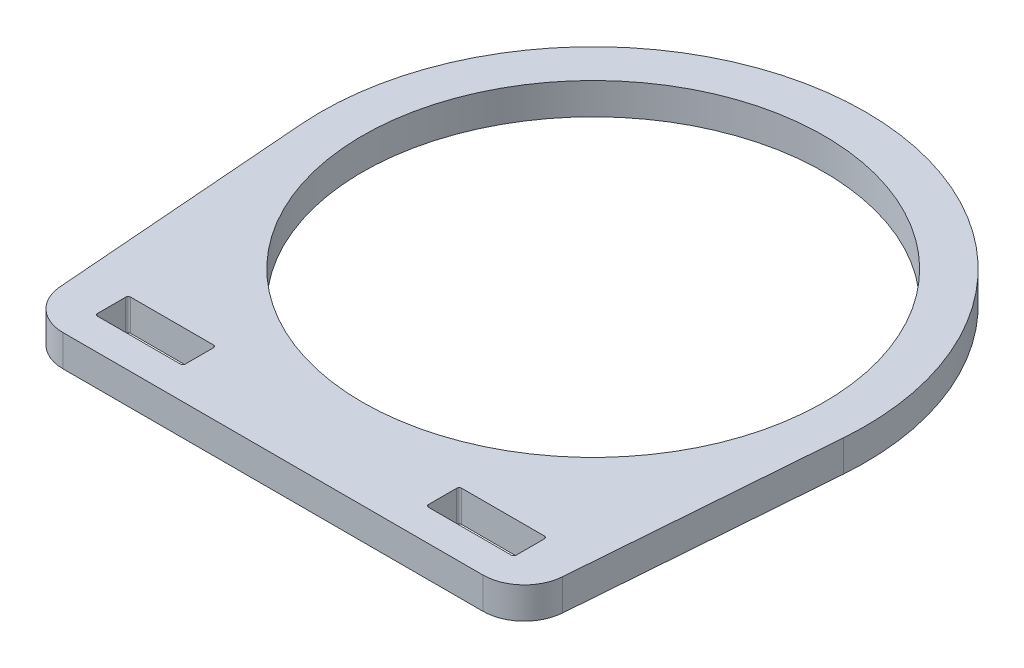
ISO-10303-21;
HEADER;
FILE_DESCRIPTION(('STEP AP214'),'2;1');
FILE_NAME('part.step','',(''),(''),'','','');
FILE_SCHEMA(('AUTOMOTIVE_DESIGN { 1 0 10303 214 1 1 1 1 }'));
ENDSEC;
DATA;
#1=APPLICATION_CONTEXT('core data for automotive mechanical design processes');
#2=APPLICATION_PROTOCOL_DEFINITION('international standard','automotive_design',2000,#1);
#3=PRODUCT_CONTEXT('',#1,'mechanical');
#4=PRODUCT('Part','Part','',(#3));
#5=PRODUCT_RELATED_PRODUCT_CATEGORY('part','',(#4));
#6=PRODUCT_DEFINITION_FORMATION('','',#4);
#7=PRODUCT_DEFINITION_CONTEXT('part definition',#1,'design');
#8=PRODUCT_DEFINITION('design','',#6,#7);
#9=PRODUCT_DEFINITION_SHAPE('','',#8);
#10=(LENGTH_UNIT() NAMED_UNIT(*) SI_UNIT(.MILLI.,.METRE.));
#11=(NAMED_UNIT(*) PLANE_ANGLE_UNIT() SI_UNIT($,.RADIAN.));
#12=(NAMED_UNIT(*) SI_UNIT($,.STERADIAN.) SOLID_ANGLE_UNIT());
#13=UNCERTAINTY_MEASURE_WITH_UNIT(LENGTH_MEASURE(1.E-05),#10,'distance_accuracy_value','');
#14=(GEOMETRIC_REPRESENTATION_CONTEXT(3) GLOBAL_UNCERTAINTY_ASSIGNED_CONTEXT((#13)) GLOBAL_UNIT_ASSIGNED_CONTEXT((#10,
#11,#12)) REPRESENTATION_CONTEXT('',''));
#15=CARTESIAN_POINT('',(0.,0.,0.));
#16=DIRECTION('',(0.,0.,1.));
#17=DIRECTION('',(1.,0.,0.));
#18=AXIS2_PLACEMENT_3D('',#15,#16,#17);
#19=CARTESIAN_POINT('',(0.,9.652,-98.298));
#20=DIRECTION('',(0.,-1.,0.));
#21=DIRECTION('',(0.,0.,-1.));
#22=AXIS2_PLACEMENT_3D('',#19,#20,#21);
#23=PLANE('',#22);
#24=DIRECTION('',(0.,0.,1.));
#25=VECTOR('',#24,1.);
#26=CARTESIAN_POINT('',(-64.262,9.652,-19.812));
#27=LINE('',#26,#25);
#28=CARTESIAN_POINT('',(-64.262,9.652,-19.05));
#29=VERTEX_POINT('',#28);
#30=CARTESIAN_POINT('',(-64.262,9.652,-10.414));
#31=VERTEX_POINT('',#30);
#32=EDGE_CURVE('E314',#29,#31,#27,.T.);
#33=ORIENTED_EDGE('',*,*,#32,.F.);
#34=CARTESIAN_POINT('',(-63.5,9.652,-19.05));
#35=DIRECTION('',(0.,-1.,0.));
#36=DIRECTION('',(0.,0.,-1.));
#37=AXIS2_PLACEMENT_3D('',#34,#35,#36);
#38=CIRCLE('',#37,0.762);
#39=CARTESIAN_POINT('',(-63.5,9.652,-19.812));
#40=VERTEX_POINT('',#39);
#41=EDGE_CURVE('E295',#29,#40,#38,.T.);
#42=ORIENTED_EDGE('',*,*,#41,.T.);
#43=DIRECTION('',(-1.,0.,0.));
#44=VECTOR('',#43,1.);
#45=CARTESIAN_POINT('',(-64.262,9.652,-19.812));
#46=LINE('',#45,#44);
#47=CARTESIAN_POINT('',(-38.1,9.652,-19.812));
#48=VERTEX_POINT('',#47);
#49=EDGE_CURVE('E327',#48,#40,#46,.T.);
#50=ORIENTED_EDGE('',*,*,#49,.F.);
#51=CARTESIAN_POINT('',(-38.1,9.652,-19.05));
#52=DIRECTION('',(0.,-1.,0.));
#53=DIRECTION('',(0.,0.,-1.));
#54=AXIS2_PLACEMENT_3D('',#51,#52,#53);
#55=CIRCLE('',#54,0.762);
#56=CARTESIAN_POINT('',(-37.338,9.652,-19.05));
#57=VERTEX_POINT('',#56);
#58=EDGE_CURVE('E291',#48,#57,#55,.T.);
#59=ORIENTED_EDGE('',*,*,#58,.T.);
#60=DIRECTION('',(0.,0.,-1.));
#61=VECTOR('',#60,1.);
#62=CARTESIAN_POINT('',(-37.338,9.652,-19.812));
#63=LINE('',#62,#61);
#64=CARTESIAN_POINT('',(-37.338,9.652,-10.414));
#65=VERTEX_POINT('',#64);
#66=EDGE_CURVE('E319',#65,#57,#63,.T.);
#67=ORIENTED_EDGE('',*,*,#66,.F.);
#68=CARTESIAN_POINT('',(-38.1,9.652,-10.414));
#69=DIRECTION('',(0.,-1.,0.));
#70=DIRECTION('',(0.,0.,-1.));
#71=AXIS2_PLACEMENT_3D('',#68,#69,#70);
#72=CIRCLE('',#71,0.762);
#73=CARTESIAN_POINT('',(-38.1,9.652,-9.652));
#74=VERTEX_POINT('',#73);
#75=EDGE_CURVE('E287',#65,#74,#72,.T.);
#76=ORIENTED_EDGE('',*,*,#75,.T.);
#77=DIRECTION('',(1.,0.,0.));
#78=VECTOR('',#77,1.);
#79=CARTESIAN_POINT('',(-64.262,9.652,-9.652));
#80=LINE('',#79,#78);
#81=CARTESIAN_POINT('',(-63.5,9.652,-9.652));
#82=VERTEX_POINT('',#81);
#83=EDGE_CURVE('E316',#82,#74,#80,.T.);
#84=ORIENTED_EDGE('',*,*,#83,.F.);
#85=CARTESIAN_POINT('',(-63.5,9.652,-10.414));
#86=DIRECTION('',(0.,-1.,0.));
#87=DIRECTION('',(0.,0.,-1.));
#88=AXIS2_PLACEMENT_3D('',#85,#86,#87);
#89=CIRCLE('',#88,0.762);
#90=EDGE_CURVE('E11',#82,#31,#89,.T.);
#91=ORIENTED_EDGE('',*,*,#90,.T.);
#92=EDGE_LOOP('',(#33,#42,#50,#59,#67,#76,#84,#91));
#93=FACE_BOUND('',#92,.T.);
#94=DIRECTION('',(1.,0.,0.));
#95=VECTOR('',#94,1.);
#96=CARTESIAN_POINT('',(-76.2,9.652,0.));
#97=LINE('',#96,#95);
#98=CARTESIAN_POINT('',(-64.4459745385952,9.652,0.));
#99=VERTEX_POINT('',#98);
#100=CARTESIAN_POINT('',(64.4459745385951,9.652,0.));
#101=VERTEX_POINT('',#100);
#102=EDGE_CURVE('E204',#99,#101,#97,.T.);
#103=ORIENTED_EDGE('',*,*,#102,.T.);
#104=CARTESIAN_POINT('',(64.4459745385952,9.652,-12.7));
#105=DIRECTION('',(0.,-1.,0.));
#106=DIRECTION('',(0.,0.,-1.));
#107=AXIS2_PLACEMENT_3D('',#104,#105,#106);
#108=CIRCLE('',#107,12.7);
#109=CARTESIAN_POINT('',(77.1080218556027,9.652,-11.7188997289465));
#110=VERTEX_POINT('',#109);
#111=EDGE_CURVE('E226',#101,#110,#108,.F.);
#112=ORIENTED_EDGE('',*,*,#111,.T.);
#113=DIRECTION('',(0.0772519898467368,0.,-0.997011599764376));
#114=VECTOR('',#113,1.);
#115=CARTESIAN_POINT('',(76.2,9.652,0.));
#116=LINE('',#115,#114);
#117=CARTESIAN_POINT('',(83.3162713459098,9.652,-91.8423602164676));
#118=VERTEX_POINT('',#117);
#119=EDGE_CURVE('E210',#110,#118,#116,.T.);
#120=ORIENTED_EDGE('',*,*,#119,.T.);
#121=CARTESIAN_POINT('',(0.,9.652,-98.298));
#122=DIRECTION('',(0.,1.,0.));
#123=DIRECTION('',(0.,0.,-1.));
#124=AXIS2_PLACEMENT_3D('',#121,#122,#123);
#125=CIRCLE('',#124,83.566);
#126=CARTESIAN_POINT('',(-83.3162713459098,9.652,-91.8423602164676));
#127=VERTEX_POINT('',#126);
#128=EDGE_CURVE('E193',#118,#127,#125,.T.);
#129=ORIENTED_EDGE('',*,*,#128,.T.);
#130=DIRECTION('',(0.0772519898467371,0.,0.997011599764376));
#131=VECTOR('',#130,1.);
#132=CARTESIAN_POINT('',(-76.2,9.652,0.));
#133=LINE('',#132,#131);
#134=CARTESIAN_POINT('',(-77.1080218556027,9.652,-11.7188997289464));
#135=VERTEX_POINT('',#134);
#136=EDGE_CURVE('E201',#127,#135,#133,.T.);
#137=ORIENTED_EDGE('',*,*,#136,.T.);
#138=CARTESIAN_POINT('',(-64.4459745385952,9.652,-12.7));
#139=DIRECTION('',(0.,-1.,0.));
#140=DIRECTION('',(0.,0.,-1.));
#141=AXIS2_PLACEMENT_3D('',#138,#139,#140);
#142=CIRCLE('',#141,12.7);
#143=EDGE_CURVE('E224',#135,#99,#142,.F.);
#144=ORIENTED_EDGE('',*,*,#143,.T.);
#145=EDGE_LOOP('',(#103,#112,#120,#129,#137,#144));
#146=FACE_BOUND('',#145,.T.);
#147=CARTESIAN_POINT('',(0.,9.652,-98.298));
#148=DIRECTION('',(0.,1.,0.));
#149=DIRECTION('',(0.,0.,1.));
#150=AXIS2_PLACEMENT_3D('',#147,#148,#149);
#151=CIRCLE('',#150,70.866);
#152=CARTESIAN_POINT('',(0.,9.652,-27.432));
#153=VERTEX_POINT('',#152);
#154=EDGE_CURVE('E333',#153,#153,#151,.T.);
#155=ORIENTED_EDGE('',*,*,#154,.F.);
#156=EDGE_LOOP('',(#155));
#157=FACE_BOUND('',#156,.T.);
#158=DIRECTION('',(0.,0.,1.));
#159=VECTOR('',#158,1.);
#160=CARTESIAN_POINT('',(37.338,9.652,-19.812));
#161=LINE('',#160,#159);
#162=CARTESIAN_POINT('',(37.338,9.652,-19.05));
#163=VERTEX_POINT('',#162);
#164=CARTESIAN_POINT('',(37.338,9.652,-10.414));
#165=VERTEX_POINT('',#164);
#166=EDGE_CURVE('E498',#163,#165,#161,.T.);
#167=ORIENTED_EDGE('',*,*,#166,.F.);
#168=CARTESIAN_POINT('',(38.1,9.652,-19.05));
#169=DIRECTION('',(0.,-1.,0.));
#170=DIRECTION('',(0.,0.,-1.));
#171=AXIS2_PLACEMENT_3D('',#168,#169,#170);
#172=CIRCLE('',#171,0.762);
#173=CARTESIAN_POINT('',(38.1,9.652,-19.812));
#174=VERTEX_POINT('',#173);
#175=EDGE_CURVE('E275',#163,#174,#172,.T.);
#176=ORIENTED_EDGE('',*,*,#175,.T.);
#177=DIRECTION('',(-1.,0.,0.));
#178=VECTOR('',#177,1.);
#179=CARTESIAN_POINT('',(37.338,9.652,-19.812));
#180=LINE('',#179,#178);
#181=CARTESIAN_POINT('',(63.5,9.652,-19.812));
#182=VERTEX_POINT('',#181);
#183=EDGE_CURVE('E512',#182,#174,#180,.T.);
#184=ORIENTED_EDGE('',*,*,#183,.F.);
#185=CARTESIAN_POINT('',(63.5,9.652,-19.05));
#186=DIRECTION('',(0.,-1.,0.));
#187=DIRECTION('',(0.,0.,-1.));
#188=AXIS2_PLACEMENT_3D('',#185,#186,#187);
#189=CIRCLE('',#188,0.762);
#190=CARTESIAN_POINT('',(64.262,9.652,-19.05));
#191=VERTEX_POINT('',#190);
#192=EDGE_CURVE('E271',#182,#191,#189,.T.);
#193=ORIENTED_EDGE('',*,*,#192,.T.);
#194=DIRECTION('',(0.,0.,-1.));
#195=VECTOR('',#194,1.);
#196=CARTESIAN_POINT('',(64.262,9.652,-19.812));
#197=LINE('',#196,#195);
#198=CARTESIAN_POINT('',(64.262,9.652,-10.414));
#199=VERTEX_POINT('',#198);
#200=EDGE_CURVE('E509',#199,#191,#197,.T.);
#201=ORIENTED_EDGE('',*,*,#200,.F.);
#202=CARTESIAN_POINT('',(63.5,9.652,-10.414));
#203=DIRECTION('',(0.,-1.,0.));
#204=DIRECTION('',(0.,0.,-1.));
#205=AXIS2_PLACEMENT_3D('',#202,#203,#204);
#206=CIRCLE('',#205,0.762);
#207=CARTESIAN_POINT('',(63.5,9.652,-9.652));
#208=VERTEX_POINT('',#207);
#209=EDGE_CURVE('E283',#199,#208,#206,.T.);
#210=ORIENTED_EDGE('',*,*,#209,.T.);
#211=DIRECTION('',(1.,0.,0.));
#212=VECTOR('',#211,1.);
#213=CARTESIAN_POINT('',(37.338,9.652,-9.652));
#214=LINE('',#213,#212);
#215=CARTESIAN_POINT('',(38.1,9.652,-9.652));
#216=VERTEX_POINT('',#215);
#217=EDGE_CURVE('E506',#216,#208,#214,.T.);
#218=ORIENTED_EDGE('',*,*,#217,.F.);
#219=CARTESIAN_POINT('',(38.1,9.652,-10.414));
#220=DIRECTION('',(0.,-1.,0.));
#221=DIRECTION('',(0.,0.,-1.));
#222=AXIS2_PLACEMENT_3D('',#219,#220,#221);
#223=CIRCLE('',#222,0.762);
#224=EDGE_CURVE('E279',#216,#165,#223,.T.);
#225=ORIENTED_EDGE('',*,*,#224,.T.);
#226=EDGE_LOOP('',(#167,#176,#184,#193,#201,#210,#218,#225));
#227=FACE_BOUND('',#226,.T.);
#228=ADVANCED_FACE('F26',(#93,#146,#157,#227),#23,.F.);
#229=CARTESIAN_POINT('',(0.,0.,-98.298));
#230=DIRECTION('',(0.,-1.,0.));
#231=DIRECTION('',(0.,0.,-1.));
#232=AXIS2_PLACEMENT_3D('',#229,#230,#231);
#233=PLANE('',#232);
#234=DIRECTION('',(0.,0.,-1.));
#235=VECTOR('',#234,1.);
#236=CARTESIAN_POINT('',(-37.338,0.,-19.812));
#237=LINE('',#236,#235);
#238=CARTESIAN_POINT('',(-37.338,0.,-10.414));
#239=VERTEX_POINT('',#238);
#240=CARTESIAN_POINT('',(-37.338,0.,-19.05));
#241=VERTEX_POINT('',#240);
#242=EDGE_CURVE('E310',#239,#241,#237,.T.);
#243=ORIENTED_EDGE('',*,*,#242,.T.);
#244=CARTESIAN_POINT('',(-38.1,0.,-19.05));
#245=DIRECTION('',(0.,-1.,0.));
#246=DIRECTION('',(0.,0.,-1.));
#247=AXIS2_PLACEMENT_3D('',#244,#245,#246);
#248=CIRCLE('',#247,0.762);
#249=CARTESIAN_POINT('',(-38.1,0.,-19.812));
#250=VERTEX_POINT('',#249);
#251=EDGE_CURVE('E289',#241,#250,#248,.F.);
#252=ORIENTED_EDGE('',*,*,#251,.T.);
#253=DIRECTION('',(-1.,0.,0.));
#254=VECTOR('',#253,1.);
#255=CARTESIAN_POINT('',(-64.262,0.,-19.812));
#256=LINE('',#255,#254);
#257=CARTESIAN_POINT('',(-63.5,0.,-19.812));
#258=VERTEX_POINT('',#257);
#259=EDGE_CURVE('E317',#250,#258,#256,.T.);
#260=ORIENTED_EDGE('',*,*,#259,.T.);
#261=CARTESIAN_POINT('',(-63.5,0.,-19.05));
#262=DIRECTION('',(0.,-1.,0.));
#263=DIRECTION('',(0.,0.,-1.));
#264=AXIS2_PLACEMENT_3D('',#261,#262,#263);
#265=CIRCLE('',#264,0.762);
#266=CARTESIAN_POINT('',(-64.262,0.,-19.05));
#267=VERTEX_POINT('',#266);
#268=EDGE_CURVE('E293',#258,#267,#265,.F.);
#269=ORIENTED_EDGE('',*,*,#268,.T.);
#270=DIRECTION('',(0.,0.,1.));
#271=VECTOR('',#270,1.);
#272=CARTESIAN_POINT('',(-64.262,0.,-19.812));
#273=LINE('',#272,#271);
#274=CARTESIAN_POINT('',(-64.262,0.,-10.414));
#275=VERTEX_POINT('',#274);
#276=EDGE_CURVE('E302',#267,#275,#273,.T.);
#277=ORIENTED_EDGE('',*,*,#276,.T.);
#278=CARTESIAN_POINT('',(-63.5,0.,-10.414));
#279=DIRECTION('',(0.,-1.,0.));
#280=DIRECTION('',(0.,0.,-1.));
#281=AXIS2_PLACEMENT_3D('',#278,#279,#280);
#282=CIRCLE('',#281,0.762);
#283=CARTESIAN_POINT('',(-63.5,0.,-9.652));
#284=VERTEX_POINT('',#283);
#285=EDGE_CURVE('E34',#275,#284,#282,.F.);
#286=ORIENTED_EDGE('',*,*,#285,.T.);
#287=DIRECTION('',(1.,0.,0.));
#288=VECTOR('',#287,1.);
#289=CARTESIAN_POINT('',(-64.262,0.,-9.652));
#290=LINE('',#289,#288);
#291=CARTESIAN_POINT('',(-38.1,0.,-9.652));
#292=VERTEX_POINT('',#291);
#293=EDGE_CURVE('E301',#284,#292,#290,.T.);
#294=ORIENTED_EDGE('',*,*,#293,.T.);
#295=CARTESIAN_POINT('',(-38.1,0.,-10.414));
#296=DIRECTION('',(0.,-1.,0.));
#297=DIRECTION('',(0.,0.,-1.));
#298=AXIS2_PLACEMENT_3D('',#295,#296,#297);
#299=CIRCLE('',#298,0.762);
#300=EDGE_CURVE('E285',#292,#239,#299,.F.);
#301=ORIENTED_EDGE('',*,*,#300,.T.);
#302=EDGE_LOOP('',(#243,#252,#260,#269,#277,#286,#294,#301));
#303=FACE_BOUND('',#302,.T.);
#304=DIRECTION('',(0.0772519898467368,0.,-0.997011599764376));
#305=VECTOR('',#304,1.);
#306=CARTESIAN_POINT('',(76.2,0.,0.));
#307=LINE('',#306,#305);
#308=CARTESIAN_POINT('',(77.1080218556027,0.,-11.7188997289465));
#309=VERTEX_POINT('',#308);
#310=CARTESIAN_POINT('',(83.3162713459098,0.,-91.8423602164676));
#311=VERTEX_POINT('',#310);
#312=EDGE_CURVE('E176',#309,#311,#307,.T.);
#313=ORIENTED_EDGE('',*,*,#312,.F.);
#314=CARTESIAN_POINT('',(64.4459745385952,0.,-12.7));
#315=DIRECTION('',(0.,-1.,0.));
#316=DIRECTION('',(0.,0.,-1.));
#317=AXIS2_PLACEMENT_3D('',#314,#315,#316);
#318=CIRCLE('',#317,12.7);
#319=CARTESIAN_POINT('',(64.4459745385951,0.,0.));
#320=VERTEX_POINT('',#319);
#321=EDGE_CURVE('E217',#309,#320,#318,.T.);
#322=ORIENTED_EDGE('',*,*,#321,.T.);
#323=DIRECTION('',(1.,0.,0.));
#324=VECTOR('',#323,1.);
#325=CARTESIAN_POINT('',(-76.2,0.,0.));
#326=LINE('',#325,#324);
#327=CARTESIAN_POINT('',(-64.4459745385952,0.,0.));
#328=VERTEX_POINT('',#327);
#329=EDGE_CURVE('E187',#328,#320,#326,.T.);
#330=ORIENTED_EDGE('',*,*,#329,.F.);
#331=CARTESIAN_POINT('',(-64.4459745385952,0.,-12.7));
#332=DIRECTION('',(0.,-1.,0.));
#333=DIRECTION('',(0.,0.,-1.));
#334=AXIS2_PLACEMENT_3D('',#331,#332,#333);
#335=CIRCLE('',#334,12.7);
#336=CARTESIAN_POINT('',(-77.1080218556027,0.,-11.7188997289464));
#337=VERTEX_POINT('',#336);
#338=EDGE_CURVE('E215',#328,#337,#335,.T.);
#339=ORIENTED_EDGE('',*,*,#338,.T.);
#340=DIRECTION('',(0.0772519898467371,0.,0.997011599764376));
#341=VECTOR('',#340,1.);
#342=CARTESIAN_POINT('',(-76.2,0.,0.));
#343=LINE('',#342,#341);
#344=CARTESIAN_POINT('',(-83.3162713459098,0.,-91.8423602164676));
#345=VERTEX_POINT('',#344);
#346=EDGE_CURVE('E200',#345,#337,#343,.T.);
#347=ORIENTED_EDGE('',*,*,#346,.F.);
#348=CARTESIAN_POINT('',(0.,0.,-98.298));
#349=DIRECTION('',(0.,1.,0.));
#350=DIRECTION('',(0.,0.,-1.));
#351=AXIS2_PLACEMENT_3D('',#348,#349,#350);
#352=CIRCLE('',#351,83.566);
#353=EDGE_CURVE('E186',#311,#345,#352,.T.);
#354=ORIENTED_EDGE('',*,*,#353,.F.);
#355=EDGE_LOOP('',(#313,#322,#330,#339,#347,#354));
#356=FACE_BOUND('',#355,.T.);
#357=CARTESIAN_POINT('',(0.,0.,-98.298));
#358=DIRECTION('',(0.,1.,0.));
#359=DIRECTION('',(0.,0.,1.));
#360=AXIS2_PLACEMENT_3D('',#357,#358,#359);
#361=CIRCLE('',#360,70.866);
#362=CARTESIAN_POINT('',(0.,0.,-27.432));
#363=VERTEX_POINT('',#362);
#364=EDGE_CURVE('E330',#363,#363,#361,.T.);
#365=ORIENTED_EDGE('',*,*,#364,.T.);
#366=EDGE_LOOP('',(#365));
#367=FACE_BOUND('',#366,.T.);
#368=DIRECTION('',(0.,0.,-1.));
#369=VECTOR('',#368,1.);
#370=CARTESIAN_POINT('',(64.262,0.,-19.812));
#371=LINE('',#370,#369);
#372=CARTESIAN_POINT('',(64.262,0.,-10.414));
#373=VERTEX_POINT('',#372);
#374=CARTESIAN_POINT('',(64.262,0.,-19.05));
#375=VERTEX_POINT('',#374);
#376=EDGE_CURVE('E490',#373,#375,#371,.T.);
#377=ORIENTED_EDGE('',*,*,#376,.T.);
#378=CARTESIAN_POINT('',(63.5,0.,-19.05));
#379=DIRECTION('',(0.,-1.,0.));
#380=DIRECTION('',(0.,0.,-1.));
#381=AXIS2_PLACEMENT_3D('',#378,#379,#380);
#382=CIRCLE('',#381,0.762);
#383=CARTESIAN_POINT('',(63.5,0.,-19.812));
#384=VERTEX_POINT('',#383);
#385=EDGE_CURVE('E269',#375,#384,#382,.F.);
#386=ORIENTED_EDGE('',*,*,#385,.T.);
#387=DIRECTION('',(-1.,0.,0.));
#388=VECTOR('',#387,1.);
#389=CARTESIAN_POINT('',(37.338,0.,-19.812));
#390=LINE('',#389,#388);
#391=CARTESIAN_POINT('',(38.1,0.,-19.812));
#392=VERTEX_POINT('',#391);
#393=EDGE_CURVE('E495',#384,#392,#390,.T.);
#394=ORIENTED_EDGE('',*,*,#393,.T.);
#395=CARTESIAN_POINT('',(38.1,0.,-19.05));
#396=DIRECTION('',(0.,-1.,0.));
#397=DIRECTION('',(0.,0.,-1.));
#398=AXIS2_PLACEMENT_3D('',#395,#396,#397);
#399=CIRCLE('',#398,0.762);
#400=CARTESIAN_POINT('',(37.338,0.,-19.05));
#401=VERTEX_POINT('',#400);
#402=EDGE_CURVE('E273',#392,#401,#399,.F.);
#403=ORIENTED_EDGE('',*,*,#402,.T.);
#404=DIRECTION('',(0.,0.,1.));
#405=VECTOR('',#404,1.);
#406=CARTESIAN_POINT('',(37.338,0.,-19.812));
#407=LINE('',#406,#405);
#408=CARTESIAN_POINT('',(37.338,0.,-10.414));
#409=VERTEX_POINT('',#408);
#410=EDGE_CURVE('E500',#401,#409,#407,.T.);
#411=ORIENTED_EDGE('',*,*,#410,.T.);
#412=CARTESIAN_POINT('',(38.1,0.,-10.414));
#413=DIRECTION('',(0.,-1.,0.));
#414=DIRECTION('',(0.,0.,-1.));
#415=AXIS2_PLACEMENT_3D('',#412,#413,#414);
#416=CIRCLE('',#415,0.762);
#417=CARTESIAN_POINT('',(38.1,0.,-9.652));
#418=VERTEX_POINT('',#417);
#419=EDGE_CURVE('E277',#409,#418,#416,.F.);
#420=ORIENTED_EDGE('',*,*,#419,.T.);
#421=DIRECTION('',(1.,0.,0.));
#422=VECTOR('',#421,1.);
#423=CARTESIAN_POINT('',(37.338,0.,-9.652));
#424=LINE('',#423,#422);
#425=CARTESIAN_POINT('',(63.5,0.,-9.652));
#426=VERTEX_POINT('',#425);
#427=EDGE_CURVE('E496',#418,#426,#424,.T.);
#428=ORIENTED_EDGE('',*,*,#427,.T.);
#429=CARTESIAN_POINT('',(63.5,0.,-10.414));
#430=DIRECTION('',(0.,-1.,0.));
#431=DIRECTION('',(0.,0.,-1.));
#432=AXIS2_PLACEMENT_3D('',#429,#430,#431);
#433=CIRCLE('',#432,0.762);
#434=EDGE_CURVE('E281',#426,#373,#433,.F.);
#435=ORIENTED_EDGE('',*,*,#434,.T.);
#436=EDGE_LOOP('',(#377,#386,#394,#403,#411,#420,#428,#435));
#437=FACE_BOUND('',#436,.T.);
#438=ADVANCED_FACE('F197',(#303,#356,#367,#437),#233,.T.);
#439=CARTESIAN_POINT('',(-76.2,9.652,0.));
#440=DIRECTION('',(0.997011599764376,0.,-0.0772519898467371));
#441=DIRECTION('',(-0.0772519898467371,0.,-0.997011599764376));
#442=AXIS2_PLACEMENT_3D('',#439,#440,#441);
#443=PLANE('',#442);
#444=ORIENTED_EDGE('',*,*,#346,.T.);
#445=DIRECTION('',(0.,-1.,0.));
#446=VECTOR('',#445,1.);
#447=CARTESIAN_POINT('',(-77.1080218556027,9.652,-11.7188997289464));
#448=LINE('',#447,#446);
#449=EDGE_CURVE('E228',#337,#135,#448,.F.);
#450=ORIENTED_EDGE('',*,*,#449,.T.);
#451=ORIENTED_EDGE('',*,*,#136,.F.);
#452=DIRECTION('',(0.,-1.,0.));
#453=VECTOR('',#452,1.);
#454=CARTESIAN_POINT('',(-83.3162713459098,9.652,-91.8423602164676));
#455=LINE('',#454,#453);
#456=EDGE_CURVE('E194',#127,#345,#455,.T.);
#457=ORIENTED_EDGE('',*,*,#456,.T.);
#458=EDGE_LOOP('',(#444,#450,#451,#457));
#459=FACE_BOUND('',#458,.T.);
#460=ADVANCED_FACE('F28',(#459),#443,.F.);
#461=CARTESIAN_POINT('',(-76.2,9.652,0.));
#462=DIRECTION('',(0.,0.,-1.));
#463=DIRECTION('',(-1.,0.,0.));
#464=AXIS2_PLACEMENT_3D('',#461,#462,#463);
#465=PLANE('',#464);
#466=ORIENTED_EDGE('',*,*,#329,.T.);
#467=DIRECTION('',(0.,-1.,0.));
#468=VECTOR('',#467,1.);
#469=CARTESIAN_POINT('',(64.4459745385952,9.652,0.));
#470=LINE('',#469,#468);
#471=EDGE_CURVE('E222',#320,#101,#470,.F.);
#472=ORIENTED_EDGE('',*,*,#471,.T.);
#473=ORIENTED_EDGE('',*,*,#102,.F.);
#474=DIRECTION('',(0.,-1.,0.));
#475=VECTOR('',#474,1.);
#476=CARTESIAN_POINT('',(-64.4459745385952,9.652,0.));
#477=LINE('',#476,#475);
#478=EDGE_CURVE('E219',#99,#328,#477,.T.);
#479=ORIENTED_EDGE('',*,*,#478,.T.);
#480=EDGE_LOOP('',(#466,#472,#473,#479));
#481=FACE_BOUND('',#480,.T.);
#482=ADVANCED_FACE('F340',(#481),#465,.F.);
#483=CARTESIAN_POINT('',(76.2,9.652,0.));
#484=DIRECTION('',(-0.997011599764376,0.,-0.0772519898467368));
#485=DIRECTION('',(-0.0772519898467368,0.,0.997011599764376));
#486=AXIS2_PLACEMENT_3D('',#483,#484,#485);
#487=PLANE('',#486);
#488=ORIENTED_EDGE('',*,*,#119,.F.);
#489=DIRECTION('',(0.,-1.,0.));
#490=VECTOR('',#489,1.);
#491=CARTESIAN_POINT('',(77.1080218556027,9.652,-11.7188997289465));
#492=LINE('',#491,#490);
#493=EDGE_CURVE('E183',#110,#309,#492,.T.);
#494=ORIENTED_EDGE('',*,*,#493,.T.);
#495=ORIENTED_EDGE('',*,*,#312,.T.);
#496=DIRECTION('',(0.,-1.,0.));
#497=VECTOR('',#496,1.);
#498=CARTESIAN_POINT('',(83.3162713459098,9.652,-91.8423602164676));
#499=LINE('',#498,#497);
#500=EDGE_CURVE('E180',#118,#311,#499,.T.);
#501=ORIENTED_EDGE('',*,*,#500,.F.);
#502=EDGE_LOOP('',(#488,#494,#495,#501));
#503=FACE_BOUND('',#502,.T.);
#504=ADVANCED_FACE('F179',(#503),#487,.F.);
#505=CARTESIAN_POINT('',(0.,9.652,-98.298));
#506=DIRECTION('',(0.,-1.,0.));
#507=DIRECTION('',(0.,0.,-1.));
#508=AXIS2_PLACEMENT_3D('',#505,#506,#507);
#509=CYLINDRICAL_SURFACE('',#508,83.566);
#510=ORIENTED_EDGE('',*,*,#353,.T.);
#511=ORIENTED_EDGE('',*,*,#456,.F.);
#512=ORIENTED_EDGE('',*,*,#128,.F.);
#513=ORIENTED_EDGE('',*,*,#500,.T.);
#514=EDGE_LOOP('',(#510,#511,#512,#513));
#515=FACE_BOUND('',#514,.T.);
#516=ADVANCED_FACE('F190',(#515),#509,.T.);
#517=CARTESIAN_POINT('',(0.,9.652,-98.298));
#518=DIRECTION('',(0.,-1.,0.));
#519=DIRECTION('',(0.,0.,-1.));
#520=AXIS2_PLACEMENT_3D('',#517,#518,#519);
#521=CYLINDRICAL_SURFACE('',#520,70.866);
#522=ORIENTED_EDGE('',*,*,#154,.T.);
#523=EDGE_LOOP('',(#522));
#524=FACE_BOUND('',#523,.T.);
#525=ORIENTED_EDGE('',*,*,#364,.F.);
#526=EDGE_LOOP('',(#525));
#527=FACE_BOUND('',#526,.T.);
#528=ADVANCED_FACE('F370',(#524,#527),#521,.F.);
#529=CARTESIAN_POINT('',(-64.262,9.652,-19.812));
#530=DIRECTION('',(1.,0.,0.));
#531=DIRECTION('',(0.,0.,-1.));
#532=AXIS2_PLACEMENT_3D('',#529,#530,#531);
#533=PLANE('',#532);
#534=ORIENTED_EDGE('',*,*,#276,.F.);
#535=DIRECTION('',(0.,-1.,0.));
#536=VECTOR('',#535,1.);
#537=CARTESIAN_POINT('',(-64.262,9.652,-19.05));
#538=LINE('',#537,#536);
#539=EDGE_CURVE('E46',#267,#29,#538,.F.);
#540=ORIENTED_EDGE('',*,*,#539,.T.);
#541=ORIENTED_EDGE('',*,*,#32,.T.);
#542=DIRECTION('',(0.,-1.,0.));
#543=VECTOR('',#542,1.);
#544=CARTESIAN_POINT('',(-64.262,0.,-10.414));
#545=LINE('',#544,#543);
#546=EDGE_CURVE('E265',#31,#275,#545,.T.);
#547=ORIENTED_EDGE('',*,*,#546,.T.);
#548=EDGE_LOOP('',(#534,#540,#541,#547));
#549=FACE_BOUND('',#548,.T.);
#550=ADVANCED_FACE('F313',(#549),#533,.T.);
#551=CARTESIAN_POINT('',(-64.262,9.652,-9.652));
#552=DIRECTION('',(0.,0.,-1.));
#553=DIRECTION('',(-1.,0.,0.));
#554=AXIS2_PLACEMENT_3D('',#551,#552,#553);
#555=PLANE('',#554);
#556=ORIENTED_EDGE('',*,*,#83,.T.);
#557=DIRECTION('',(0.,-1.,0.));
#558=VECTOR('',#557,1.);
#559=CARTESIAN_POINT('',(-38.1,0.,-9.652));
#560=LINE('',#559,#558);
#561=EDGE_CURVE('E252',#74,#292,#560,.T.);
#562=ORIENTED_EDGE('',*,*,#561,.T.);
#563=ORIENTED_EDGE('',*,*,#293,.F.);
#564=DIRECTION('',(0.,-1.,0.));
#565=VECTOR('',#564,1.);
#566=CARTESIAN_POINT('',(-63.5,9.652,-9.652));
#567=LINE('',#566,#565);
#568=EDGE_CURVE('E250',#284,#82,#567,.F.);
#569=ORIENTED_EDGE('',*,*,#568,.T.);
#570=EDGE_LOOP('',(#556,#562,#563,#569));
#571=FACE_BOUND('',#570,.T.);
#572=ADVANCED_FACE('F308',(#571),#555,.T.);
#573=CARTESIAN_POINT('',(-37.338,9.652,-19.812));
#574=DIRECTION('',(-1.,0.,0.));
#575=DIRECTION('',(0.,0.,1.));
#576=AXIS2_PLACEMENT_3D('',#573,#574,#575);
#577=PLANE('',#576);
#578=ORIENTED_EDGE('',*,*,#242,.F.);
#579=DIRECTION('',(0.,-1.,0.));
#580=VECTOR('',#579,1.);
#581=CARTESIAN_POINT('',(-37.338,9.652,-10.414));
#582=LINE('',#581,#580);
#583=EDGE_CURVE('E258',#239,#65,#582,.F.);
#584=ORIENTED_EDGE('',*,*,#583,.T.);
#585=ORIENTED_EDGE('',*,*,#66,.T.);
#586=DIRECTION('',(0.,-1.,0.));
#587=VECTOR('',#586,1.);
#588=CARTESIAN_POINT('',(-37.338,0.,-19.05));
#589=LINE('',#588,#587);
#590=EDGE_CURVE('E255',#57,#241,#589,.T.);
#591=ORIENTED_EDGE('',*,*,#590,.T.);
#592=EDGE_LOOP('',(#578,#584,#585,#591));
#593=FACE_BOUND('',#592,.T.);
#594=ADVANCED_FACE('F473',(#593),#577,.T.);
#595=CARTESIAN_POINT('',(-64.262,9.652,-19.812));
#596=DIRECTION('',(0.,0.,1.));
#597=DIRECTION('',(1.,0.,0.));
#598=AXIS2_PLACEMENT_3D('',#595,#596,#597);
#599=PLANE('',#598);
#600=ORIENTED_EDGE('',*,*,#259,.F.);
#601=DIRECTION('',(0.,-1.,0.));
#602=VECTOR('',#601,1.);
#603=CARTESIAN_POINT('',(-38.1,9.652,-19.812));
#604=LINE('',#603,#602);
#605=EDGE_CURVE('E263',#250,#48,#604,.F.);
#606=ORIENTED_EDGE('',*,*,#605,.T.);
#607=ORIENTED_EDGE('',*,*,#49,.T.);
#608=DIRECTION('',(0.,-1.,0.));
#609=VECTOR('',#608,1.);
#610=CARTESIAN_POINT('',(-63.5,0.,-19.812));
#611=LINE('',#610,#609);
#612=EDGE_CURVE('E260',#40,#258,#611,.T.);
#613=ORIENTED_EDGE('',*,*,#612,.T.);
#614=EDGE_LOOP('',(#600,#606,#607,#613));
#615=FACE_BOUND('',#614,.T.);
#616=ADVANCED_FACE('F469',(#615),#599,.T.);
#617=CARTESIAN_POINT('',(37.338,9.652,-19.812));
#618=DIRECTION('',(1.,0.,0.));
#619=DIRECTION('',(0.,0.,-1.));
#620=AXIS2_PLACEMENT_3D('',#617,#618,#619);
#621=PLANE('',#620);
#622=ORIENTED_EDGE('',*,*,#410,.F.);
#623=DIRECTION('',(0.,-1.,0.));
#624=VECTOR('',#623,1.);
#625=CARTESIAN_POINT('',(37.338,9.652,-19.05));
#626=LINE('',#625,#624);
#627=EDGE_CURVE('E243',#401,#163,#626,.F.);
#628=ORIENTED_EDGE('',*,*,#627,.T.);
#629=ORIENTED_EDGE('',*,*,#166,.T.);
#630=DIRECTION('',(0.,-1.,0.));
#631=VECTOR('',#630,1.);
#632=CARTESIAN_POINT('',(37.338,0.,-10.414));
#633=LINE('',#632,#631);
#634=EDGE_CURVE('E240',#165,#409,#633,.T.);
#635=ORIENTED_EDGE('',*,*,#634,.T.);
#636=EDGE_LOOP('',(#622,#628,#629,#635));
#637=FACE_BOUND('',#636,.T.);
#638=ADVANCED_FACE('F465',(#637),#621,.T.);
#639=CARTESIAN_POINT('',(37.338,9.652,-9.652));
#640=DIRECTION('',(0.,0.,-1.));
#641=DIRECTION('',(-1.,0.,0.));
#642=AXIS2_PLACEMENT_3D('',#639,#640,#641);
#643=PLANE('',#642);
#644=ORIENTED_EDGE('',*,*,#427,.F.);
#645=DIRECTION('',(0.,-1.,0.));
#646=VECTOR('',#645,1.);
#647=CARTESIAN_POINT('',(38.1,9.652,-9.652));
#648=LINE('',#647,#646);
#649=EDGE_CURVE('E248',#418,#216,#648,.F.);
#650=ORIENTED_EDGE('',*,*,#649,.T.);
#651=ORIENTED_EDGE('',*,*,#217,.T.);
#652=DIRECTION('',(0.,-1.,0.));
#653=VECTOR('',#652,1.);
#654=CARTESIAN_POINT('',(63.5,0.,-9.652));
#655=LINE('',#654,#653);
#656=EDGE_CURVE('E245',#208,#426,#655,.T.);
#657=ORIENTED_EDGE('',*,*,#656,.T.);
#658=EDGE_LOOP('',(#644,#650,#651,#657));
#659=FACE_BOUND('',#658,.T.);
#660=ADVANCED_FACE('F461',(#659),#643,.T.);
#661=CARTESIAN_POINT('',(64.262,9.652,-19.812));
#662=DIRECTION('',(-1.,0.,0.));
#663=DIRECTION('',(0.,0.,1.));
#664=AXIS2_PLACEMENT_3D('',#661,#662,#663);
#665=PLANE('',#664);
#666=ORIENTED_EDGE('',*,*,#200,.T.);
#667=DIRECTION('',(0.,-1.,0.));
#668=VECTOR('',#667,1.);
#669=CARTESIAN_POINT('',(64.262,0.,-19.05));
#670=LINE('',#669,#668);
#671=EDGE_CURVE('E232',#191,#375,#670,.T.);
#672=ORIENTED_EDGE('',*,*,#671,.T.);
#673=ORIENTED_EDGE('',*,*,#376,.F.);
#674=DIRECTION('',(0.,-1.,0.));
#675=VECTOR('',#674,1.);
#676=CARTESIAN_POINT('',(64.262,9.652,-10.414));
#677=LINE('',#676,#675);
#678=EDGE_CURVE('E230',#373,#199,#677,.F.);
#679=ORIENTED_EDGE('',*,*,#678,.T.);
#680=EDGE_LOOP('',(#666,#672,#673,#679));
#681=FACE_BOUND('',#680,.T.);
#682=ADVANCED_FACE('F457',(#681),#665,.T.);
#683=CARTESIAN_POINT('',(37.338,9.652,-19.812));
#684=DIRECTION('',(0.,0.,1.));
#685=DIRECTION('',(1.,0.,0.));
#686=AXIS2_PLACEMENT_3D('',#683,#684,#685);
#687=PLANE('',#686);
#688=ORIENTED_EDGE('',*,*,#393,.F.);
#689=DIRECTION('',(0.,-1.,0.));
#690=VECTOR('',#689,1.);
#691=CARTESIAN_POINT('',(63.5,9.652,-19.812));
#692=LINE('',#691,#690);
#693=EDGE_CURVE('E238',#384,#182,#692,.F.);
#694=ORIENTED_EDGE('',*,*,#693,.T.);
#695=ORIENTED_EDGE('',*,*,#183,.T.);
#696=DIRECTION('',(0.,-1.,0.));
#697=VECTOR('',#696,1.);
#698=CARTESIAN_POINT('',(38.1,0.,-19.812));
#699=LINE('',#698,#697);
#700=EDGE_CURVE('E235',#174,#392,#699,.T.);
#701=ORIENTED_EDGE('',*,*,#700,.T.);
#702=EDGE_LOOP('',(#688,#694,#695,#701));
#703=FACE_BOUND('',#702,.T.);
#704=ADVANCED_FACE('F382',(#703),#687,.T.);
#705=CARTESIAN_POINT('',(64.4459745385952,9.652,-12.7));
#706=DIRECTION('',(0.,-1.,0.));
#707=DIRECTION('',(0.,0.,-1.));
#708=AXIS2_PLACEMENT_3D('',#705,#706,#707);
#709=CYLINDRICAL_SURFACE('',#708,12.7);
#710=ORIENTED_EDGE('',*,*,#111,.F.);
#711=ORIENTED_EDGE('',*,*,#471,.F.);
#712=ORIENTED_EDGE('',*,*,#321,.F.);
#713=ORIENTED_EDGE('',*,*,#493,.F.);
#714=EDGE_LOOP('',(#710,#711,#712,#713));
#715=FACE_BOUND('',#714,.T.);
#716=ADVANCED_FACE('F345',(#715),#709,.T.);
#717=CARTESIAN_POINT('',(-64.4459745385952,9.652,-12.7));
#718=DIRECTION('',(0.,-1.,0.));
#719=DIRECTION('',(0.,0.,-1.));
#720=AXIS2_PLACEMENT_3D('',#717,#718,#719);
#721=CYLINDRICAL_SURFACE('',#720,12.7);
#722=ORIENTED_EDGE('',*,*,#143,.F.);
#723=ORIENTED_EDGE('',*,*,#449,.F.);
#724=ORIENTED_EDGE('',*,*,#338,.F.);
#725=ORIENTED_EDGE('',*,*,#478,.F.);
#726=EDGE_LOOP('',(#722,#723,#724,#725));
#727=FACE_BOUND('',#726,.T.);
#728=ADVANCED_FACE('F350',(#727),#721,.T.);
#729=CARTESIAN_POINT('',(63.5,9.652,-19.05));
#730=DIRECTION('',(0.,1.,0.));
#731=DIRECTION('',(0.,0.,1.));
#732=AXIS2_PLACEMENT_3D('',#729,#730,#731);
#733=CYLINDRICAL_SURFACE('',#732,0.762);
#734=ORIENTED_EDGE('',*,*,#192,.F.);
#735=ORIENTED_EDGE('',*,*,#693,.F.);
#736=ORIENTED_EDGE('',*,*,#385,.F.);
#737=ORIENTED_EDGE('',*,*,#671,.F.);
#738=EDGE_LOOP('',(#734,#735,#736,#737));
#739=FACE_BOUND('',#738,.T.);
#740=ADVANCED_FACE('F389',(#739),#733,.F.);
#741=CARTESIAN_POINT('',(38.1,9.652,-19.05));
#742=DIRECTION('',(0.,1.,0.));
#743=DIRECTION('',(0.,0.,1.));
#744=AXIS2_PLACEMENT_3D('',#741,#742,#743);
#745=CYLINDRICAL_SURFACE('',#744,0.762);
#746=ORIENTED_EDGE('',*,*,#175,.F.);
#747=ORIENTED_EDGE('',*,*,#627,.F.);
#748=ORIENTED_EDGE('',*,*,#402,.F.);
#749=ORIENTED_EDGE('',*,*,#700,.F.);
#750=EDGE_LOOP('',(#746,#747,#748,#749));
#751=FACE_BOUND('',#750,.T.);
#752=ADVANCED_FACE('F398',(#751),#745,.F.);
#753=CARTESIAN_POINT('',(38.1,9.652,-10.414));
#754=DIRECTION('',(0.,1.,0.));
#755=DIRECTION('',(0.,0.,1.));
#756=AXIS2_PLACEMENT_3D('',#753,#754,#755);
#757=CYLINDRICAL_SURFACE('',#756,0.762);
#758=ORIENTED_EDGE('',*,*,#224,.F.);
#759=ORIENTED_EDGE('',*,*,#649,.F.);
#760=ORIENTED_EDGE('',*,*,#419,.F.);
#761=ORIENTED_EDGE('',*,*,#634,.F.);
#762=EDGE_LOOP('',(#758,#759,#760,#761));
#763=FACE_BOUND('',#762,.T.);
#764=ADVANCED_FACE('F407',(#763),#757,.F.);
#765=CARTESIAN_POINT('',(63.5,9.652,-10.414));
#766=DIRECTION('',(0.,1.,0.));
#767=DIRECTION('',(0.,0.,1.));
#768=AXIS2_PLACEMENT_3D('',#765,#766,#767);
#769=CYLINDRICAL_SURFACE('',#768,0.762);
#770=ORIENTED_EDGE('',*,*,#209,.F.);
#771=ORIENTED_EDGE('',*,*,#678,.F.);
#772=ORIENTED_EDGE('',*,*,#434,.F.);
#773=ORIENTED_EDGE('',*,*,#656,.F.);
#774=EDGE_LOOP('',(#770,#771,#772,#773));
#775=FACE_BOUND('',#774,.T.);
#776=ADVANCED_FACE('F415',(#775),#769,.F.);
#777=CARTESIAN_POINT('',(-38.1,9.652,-10.414));
#778=DIRECTION('',(0.,1.,0.));
#779=DIRECTION('',(0.,0.,1.));
#780=AXIS2_PLACEMENT_3D('',#777,#778,#779);
#781=CYLINDRICAL_SURFACE('',#780,0.762);
#782=ORIENTED_EDGE('',*,*,#75,.F.);
#783=ORIENTED_EDGE('',*,*,#583,.F.);
#784=ORIENTED_EDGE('',*,*,#300,.F.);
#785=ORIENTED_EDGE('',*,*,#561,.F.);
#786=EDGE_LOOP('',(#782,#783,#784,#785));
#787=FACE_BOUND('',#786,.T.);
#788=ADVANCED_FACE('F423',(#787),#781,.F.);
#789=CARTESIAN_POINT('',(-38.1,9.652,-19.05));
#790=DIRECTION('',(0.,1.,0.));
#791=DIRECTION('',(0.,0.,1.));
#792=AXIS2_PLACEMENT_3D('',#789,#790,#791);
#793=CYLINDRICAL_SURFACE('',#792,0.762);
#794=ORIENTED_EDGE('',*,*,#58,.F.);
#795=ORIENTED_EDGE('',*,*,#605,.F.);
#796=ORIENTED_EDGE('',*,*,#251,.F.);
#797=ORIENTED_EDGE('',*,*,#590,.F.);
#798=EDGE_LOOP('',(#794,#795,#796,#797));
#799=FACE_BOUND('',#798,.T.);
#800=ADVANCED_FACE('F431',(#799),#793,.F.);
#801=CARTESIAN_POINT('',(-63.5,9.652,-19.05));
#802=DIRECTION('',(0.,1.,0.));
#803=DIRECTION('',(0.,0.,1.));
#804=AXIS2_PLACEMENT_3D('',#801,#802,#803);
#805=CYLINDRICAL_SURFACE('',#804,0.762);
#806=ORIENTED_EDGE('',*,*,#41,.F.);
#807=ORIENTED_EDGE('',*,*,#539,.F.);
#808=ORIENTED_EDGE('',*,*,#268,.F.);
#809=ORIENTED_EDGE('',*,*,#612,.F.);
#810=EDGE_LOOP('',(#806,#807,#808,#809));
#811=FACE_BOUND('',#810,.T.);
#812=ADVANCED_FACE('F439',(#811),#805,.F.);
#813=CARTESIAN_POINT('',(-63.5,9.652,-10.414));
#814=DIRECTION('',(0.,1.,0.));
#815=DIRECTION('',(0.,0.,1.));
#816=AXIS2_PLACEMENT_3D('',#813,#814,#815);
#817=CYLINDRICAL_SURFACE('',#816,0.762);
#818=ORIENTED_EDGE('',*,*,#90,.F.);
#819=ORIENTED_EDGE('',*,*,#568,.F.);
#820=ORIENTED_EDGE('',*,*,#285,.F.);
#821=ORIENTED_EDGE('',*,*,#546,.F.);
#822=EDGE_LOOP('',(#818,#819,#820,#821));
#823=FACE_BOUND('',#822,.T.);
#824=ADVANCED_FACE('F312',(#823),#817,.F.);
#825=CLOSED_SHELL('',(#228,#438,#460,#482,#504,#516,#528,#550,#572,#594,#616,#638,#660,#682,
#704,#716,#728,#740,#752,#764,#776,#788,#800,#812,#824));
#826=MANIFOLD_SOLID_BREP('B2',#825);
#827=ADVANCED_BREP_SHAPE_REPRESENTATION('',(#18,#826),#14);
#828=SHAPE_DEFINITION_REPRESENTATION(#9,#827);
ENDSEC;
END-ISO-10303-21;
